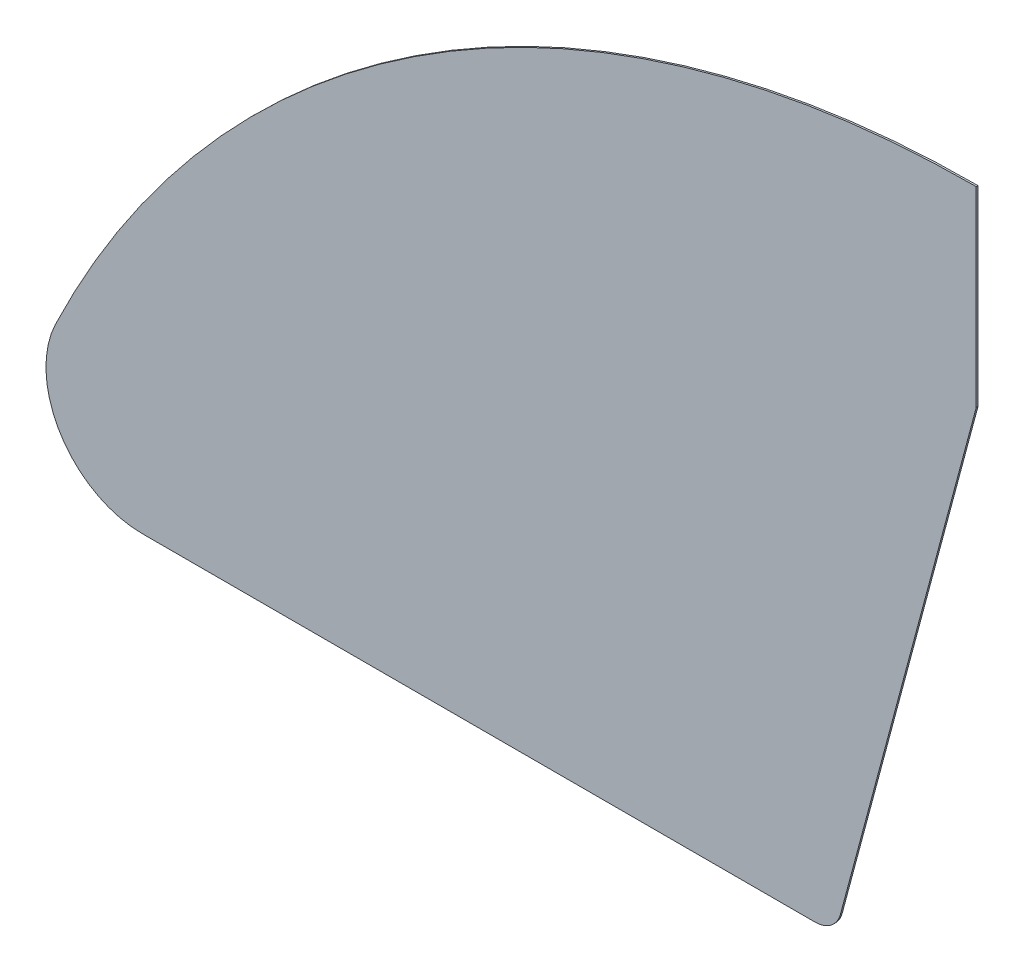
ISO-10303-21;
HEADER;
FILE_DESCRIPTION(('STEP AP214'),'2;1');
FILE_NAME('part.step','',(''),(''),'','','');
FILE_SCHEMA(('AUTOMOTIVE_DESIGN { 1 0 10303 214 1 1 1 1 }'));
ENDSEC;
DATA;
#1=APPLICATION_CONTEXT('core data for automotive mechanical design processes');
#2=APPLICATION_PROTOCOL_DEFINITION('international standard','automotive_design',2000,#1);
#3=PRODUCT_CONTEXT('',#1,'mechanical');
#4=PRODUCT('Part','Part','',(#3));
#5=PRODUCT_RELATED_PRODUCT_CATEGORY('part','',(#4));
#6=PRODUCT_DEFINITION_FORMATION('','',#4);
#7=PRODUCT_DEFINITION_CONTEXT('part definition',#1,'design');
#8=PRODUCT_DEFINITION('design','',#6,#7);
#9=PRODUCT_DEFINITION_SHAPE('','',#8);
#10=(LENGTH_UNIT() NAMED_UNIT(*) SI_UNIT(.MILLI.,.METRE.));
#11=(NAMED_UNIT(*) PLANE_ANGLE_UNIT() SI_UNIT($,.RADIAN.));
#12=(NAMED_UNIT(*) SI_UNIT($,.STERADIAN.) SOLID_ANGLE_UNIT());
#13=UNCERTAINTY_MEASURE_WITH_UNIT(LENGTH_MEASURE(1.E-05),#10,'distance_accuracy_value','');
#14=(GEOMETRIC_REPRESENTATION_CONTEXT(3) GLOBAL_UNCERTAINTY_ASSIGNED_CONTEXT((#13)) GLOBAL_UNIT_ASSIGNED_CONTEXT((#10,
#11,#12)) REPRESENTATION_CONTEXT('',''));
#15=CARTESIAN_POINT('',(0.,0.,0.));
#16=DIRECTION('',(0.,0.,1.));
#17=DIRECTION('',(1.,0.,0.));
#18=AXIS2_PLACEMENT_3D('',#15,#16,#17);
#19=CARTESIAN_POINT('',(0.955553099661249,-115.621051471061,0.2));
#20=DIRECTION('',(0.,0.,-1.));
#21=DIRECTION('',(-1.,0.,0.));
#22=AXIS2_PLACEMENT_3D('',#19,#20,#21);
#23=CYLINDRICAL_SURFACE('',#22,116.625);
#24=CARTESIAN_POINT('',(0.955553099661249,-115.621051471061,0.));
#25=DIRECTION('',(0.,0.,1.));
#26=DIRECTION('',(1.,0.,0.));
#27=AXIS2_PLACEMENT_3D('',#24,#25,#26);
#28=CIRCLE('',#27,116.625);
#29=CARTESIAN_POINT('',(1.,1.00394005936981,0.));
#30=VERTEX_POINT('',#29);
#31=CARTESIAN_POINT('',(-104.228100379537,-65.2445721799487,0.));
#32=VERTEX_POINT('',#31);
#33=EDGE_CURVE('E82',#30,#32,#28,.T.);
#34=ORIENTED_EDGE('',*,*,#33,.T.);
#35=DIRECTION('',(0.,0.,-1.));
#36=VECTOR('',#35,1.);
#37=CARTESIAN_POINT('',(-104.228100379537,-65.2445721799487,0.2));
#38=LINE('',#37,#36);
#39=CARTESIAN_POINT('',(-104.228100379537,-65.2445721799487,0.2));
#40=VERTEX_POINT('',#39);
#41=EDGE_CURVE('E11',#40,#32,#38,.T.);
#42=ORIENTED_EDGE('',*,*,#41,.F.);
#43=CARTESIAN_POINT('',(0.955553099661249,-115.621051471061,0.2));
#44=DIRECTION('',(0.,0.,1.));
#45=DIRECTION('',(1.,0.,0.));
#46=AXIS2_PLACEMENT_3D('',#43,#44,#45);
#47=CIRCLE('',#46,116.625);
#48=CARTESIAN_POINT('',(1.,1.00394005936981,0.2));
#49=VERTEX_POINT('',#48);
#50=EDGE_CURVE('E105',#49,#40,#47,.T.);
#51=ORIENTED_EDGE('',*,*,#50,.F.);
#52=DIRECTION('',(0.,0.,-1.));
#53=VECTOR('',#52,1.);
#54=CARTESIAN_POINT('',(1.,1.00394005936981,0.2));
#55=LINE('',#54,#53);
#56=EDGE_CURVE('E95',#49,#30,#55,.T.);
#57=ORIENTED_EDGE('',*,*,#56,.T.);
#58=EDGE_LOOP('',(#34,#42,#51,#57));
#59=FACE_BOUND('',#58,.T.);
#60=ADVANCED_FACE('F26',(#59),#23,.T.);
#61=CARTESIAN_POINT('',(-94.3072413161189,-69.99605147,0.2));
#62=DIRECTION('',(0.,0.,-1.));
#63=DIRECTION('',(-1.,0.,0.));
#64=AXIS2_PLACEMENT_3D('',#61,#62,#63);
#65=CYLINDRICAL_SURFACE('',#64,11.);
#66=CARTESIAN_POINT('',(-94.3072413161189,-69.99605147,0.));
#67=DIRECTION('',(0.,0.,1.));
#68=DIRECTION('',(1.,0.,0.));
#69=AXIS2_PLACEMENT_3D('',#66,#67,#68);
#70=CIRCLE('',#69,11.);
#71=CARTESIAN_POINT('',(-94.3072413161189,-80.99605147,0.));
#72=VERTEX_POINT('',#71);
#73=EDGE_CURVE('E78',#32,#72,#70,.T.);
#74=ORIENTED_EDGE('',*,*,#73,.T.);
#75=DIRECTION('',(0.,0.,-1.));
#76=VECTOR('',#75,1.);
#77=CARTESIAN_POINT('',(-94.3072413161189,-80.99605147,0.2));
#78=LINE('',#77,#76);
#79=CARTESIAN_POINT('',(-94.3072413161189,-80.99605147,0.2));
#80=VERTEX_POINT('',#79);
#81=EDGE_CURVE('E33',#80,#72,#78,.T.);
#82=ORIENTED_EDGE('',*,*,#81,.F.);
#83=CARTESIAN_POINT('',(-94.3072413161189,-69.99605147,0.2));
#84=DIRECTION('',(0.,0.,1.));
#85=DIRECTION('',(1.,0.,0.));
#86=AXIS2_PLACEMENT_3D('',#83,#84,#85);
#87=CIRCLE('',#86,11.);
#88=EDGE_CURVE('E91',#40,#80,#87,.T.);
#89=ORIENTED_EDGE('',*,*,#88,.F.);
#90=ORIENTED_EDGE('',*,*,#41,.T.);
#91=EDGE_LOOP('',(#74,#82,#89,#90));
#92=FACE_BOUND('',#91,.T.);
#93=ADVANCED_FACE('F90',(#92),#65,.T.);
#94=CARTESIAN_POINT('',(-17.4158993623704,-80.99605147,0.2));
#95=DIRECTION('',(0.,1.,0.));
#96=DIRECTION('',(0.,0.,1.));
#97=AXIS2_PLACEMENT_3D('',#94,#95,#96);
#98=PLANE('',#97);
#99=DIRECTION('',(1.,0.,0.));
#100=VECTOR('',#99,1.);
#101=CARTESIAN_POINT('',(-17.4158993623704,-80.99605147,0.));
#102=LINE('',#101,#100);
#103=CARTESIAN_POINT('',(-17.4158993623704,-80.99605147,0.));
#104=VERTEX_POINT('',#103);
#105=EDGE_CURVE('E84',#72,#104,#102,.T.);
#106=ORIENTED_EDGE('',*,*,#105,.T.);
#107=DIRECTION('',(0.,0.,-1.));
#108=VECTOR('',#107,1.);
#109=CARTESIAN_POINT('',(-17.4158993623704,-80.99605147,0.2));
#110=LINE('',#109,#108);
#111=CARTESIAN_POINT('',(-17.4158993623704,-80.99605147,0.2));
#112=VERTEX_POINT('',#111);
#113=EDGE_CURVE('E121',#112,#104,#110,.T.);
#114=ORIENTED_EDGE('',*,*,#113,.F.);
#115=DIRECTION('',(1.,0.,0.));
#116=VECTOR('',#115,1.);
#117=CARTESIAN_POINT('',(-17.4158993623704,-80.99605147,0.2));
#118=LINE('',#117,#116);
#119=EDGE_CURVE('E108',#80,#112,#118,.T.);
#120=ORIENTED_EDGE('',*,*,#119,.F.);
#121=ORIENTED_EDGE('',*,*,#81,.T.);
#122=EDGE_LOOP('',(#106,#114,#120,#121));
#123=FACE_BOUND('',#122,.T.);
#124=ADVANCED_FACE('F125',(#123),#98,.F.);
#125=CARTESIAN_POINT('',(-17.4158993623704,-77.99605147,0.2));
#126=DIRECTION('',(0.,0.,-1.));
#127=DIRECTION('',(-1.,0.,0.));
#128=AXIS2_PLACEMENT_3D('',#125,#126,#127);
#129=CYLINDRICAL_SURFACE('',#128,3.);
#130=CARTESIAN_POINT('',(-17.4158993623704,-77.99605147,0.));
#131=DIRECTION('',(0.,0.,1.));
#132=DIRECTION('',(-1.,0.,0.));
#133=AXIS2_PLACEMENT_3D('',#130,#131,#132);
#134=CIRCLE('',#133,3.);
#135=CARTESIAN_POINT('',(-14.5181218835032,-78.7725086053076,0.));
#136=VERTEX_POINT('',#135);
#137=EDGE_CURVE('E99',#104,#136,#134,.T.);
#138=ORIENTED_EDGE('',*,*,#137,.T.);
#139=DIRECTION('',(0.,0.,-1.));
#140=VECTOR('',#139,1.);
#141=CARTESIAN_POINT('',(-14.5181218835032,-78.7725086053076,0.2));
#142=LINE('',#141,#140);
#143=CARTESIAN_POINT('',(-14.5181218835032,-78.7725086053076,0.2));
#144=VERTEX_POINT('',#143);
#145=EDGE_CURVE('E118',#144,#136,#142,.T.);
#146=ORIENTED_EDGE('',*,*,#145,.F.);
#147=CARTESIAN_POINT('',(-17.4158993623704,-77.99605147,0.2));
#148=DIRECTION('',(0.,0.,1.));
#149=DIRECTION('',(-1.,0.,0.));
#150=AXIS2_PLACEMENT_3D('',#147,#148,#149);
#151=CIRCLE('',#150,3.);
#152=EDGE_CURVE('E110',#112,#144,#151,.T.);
#153=ORIENTED_EDGE('',*,*,#152,.F.);
#154=ORIENTED_EDGE('',*,*,#113,.T.);
#155=EDGE_LOOP('',(#138,#146,#153,#154));
#156=FACE_BOUND('',#155,.T.);
#157=ADVANCED_FACE('F131',(#156),#129,.T.);
#158=CARTESIAN_POINT('',(1.,-20.8580892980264,0.2));
#159=DIRECTION('',(-0.965925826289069,0.258819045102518,0.));
#160=DIRECTION('',(-0.258819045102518,-0.965925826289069,0.));
#161=AXIS2_PLACEMENT_3D('',#158,#159,#160);
#162=PLANE('',#161);
#163=DIRECTION('',(0.258819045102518,0.965925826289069,0.));
#164=VECTOR('',#163,1.);
#165=CARTESIAN_POINT('',(1.,-20.8580892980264,0.));
#166=LINE('',#165,#164);
#167=CARTESIAN_POINT('',(1.,-20.8580892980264,0.));
#168=VERTEX_POINT('',#167);
#169=EDGE_CURVE('E101',#136,#168,#166,.T.);
#170=ORIENTED_EDGE('',*,*,#169,.T.);
#171=DIRECTION('',(0.,0.,-1.));
#172=VECTOR('',#171,1.);
#173=CARTESIAN_POINT('',(1.,-20.8580892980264,0.2));
#174=LINE('',#173,#172);
#175=CARTESIAN_POINT('',(1.,-20.8580892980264,0.2));
#176=VERTEX_POINT('',#175);
#177=EDGE_CURVE('E115',#176,#168,#174,.T.);
#178=ORIENTED_EDGE('',*,*,#177,.F.);
#179=DIRECTION('',(0.258819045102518,0.965925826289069,0.));
#180=VECTOR('',#179,1.);
#181=CARTESIAN_POINT('',(1.,-20.8580892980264,0.2));
#182=LINE('',#181,#180);
#183=EDGE_CURVE('E45',#144,#176,#182,.T.);
#184=ORIENTED_EDGE('',*,*,#183,.F.);
#185=ORIENTED_EDGE('',*,*,#145,.T.);
#186=EDGE_LOOP('',(#170,#178,#184,#185));
#187=FACE_BOUND('',#186,.T.);
#188=ADVANCED_FACE('F134',(#187),#162,.F.);
#189=CARTESIAN_POINT('',(1.,1.00394005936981,0.2));
#190=DIRECTION('',(-1.,0.,0.));
#191=DIRECTION('',(0.,0.,1.));
#192=AXIS2_PLACEMENT_3D('',#189,#190,#191);
#193=PLANE('',#192);
#194=DIRECTION('',(0.,1.,0.));
#195=VECTOR('',#194,1.);
#196=CARTESIAN_POINT('',(1.,1.00394005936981,0.));
#197=LINE('',#196,#195);
#198=EDGE_CURVE('E103',#168,#30,#197,.T.);
#199=ORIENTED_EDGE('',*,*,#198,.T.);
#200=ORIENTED_EDGE('',*,*,#56,.F.);
#201=DIRECTION('',(0.,1.,0.));
#202=VECTOR('',#201,1.);
#203=CARTESIAN_POINT('',(1.,1.00394005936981,0.2));
#204=LINE('',#203,#202);
#205=EDGE_CURVE('E40',#176,#49,#204,.T.);
#206=ORIENTED_EDGE('',*,*,#205,.F.);
#207=ORIENTED_EDGE('',*,*,#177,.T.);
#208=EDGE_LOOP('',(#199,#200,#206,#207));
#209=FACE_BOUND('',#208,.T.);
#210=ADVANCED_FACE('F136',(#209),#193,.F.);
#211=CARTESIAN_POINT('',(0.955553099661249,-115.621051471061,0.2));
#212=DIRECTION('',(0.,0.,1.));
#213=DIRECTION('',(1.,0.,0.));
#214=AXIS2_PLACEMENT_3D('',#211,#212,#213);
#215=PLANE('',#214);
#216=ORIENTED_EDGE('',*,*,#50,.T.);
#217=ORIENTED_EDGE('',*,*,#88,.T.);
#218=ORIENTED_EDGE('',*,*,#119,.T.);
#219=ORIENTED_EDGE('',*,*,#152,.T.);
#220=ORIENTED_EDGE('',*,*,#183,.T.);
#221=ORIENTED_EDGE('',*,*,#205,.T.);
#222=EDGE_LOOP('',(#216,#217,#218,#219,#220,#221));
#223=FACE_BOUND('',#222,.T.);
#224=ADVANCED_FACE('F128',(#223),#215,.T.);
#225=CARTESIAN_POINT('',(0.955553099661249,-115.621051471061,0.));
#226=DIRECTION('',(0.,0.,1.));
#227=DIRECTION('',(1.,0.,0.));
#228=AXIS2_PLACEMENT_3D('',#225,#226,#227);
#229=PLANE('',#228);
#230=ORIENTED_EDGE('',*,*,#33,.F.);
#231=ORIENTED_EDGE('',*,*,#198,.F.);
#232=ORIENTED_EDGE('',*,*,#169,.F.);
#233=ORIENTED_EDGE('',*,*,#137,.F.);
#234=ORIENTED_EDGE('',*,*,#105,.F.);
#235=ORIENTED_EDGE('',*,*,#73,.F.);
#236=EDGE_LOOP('',(#230,#231,#232,#233,#234,#235));
#237=FACE_BOUND('',#236,.T.);
#238=ADVANCED_FACE('F79',(#237),#229,.F.);
#239=CLOSED_SHELL('',(#60,#93,#124,#157,#188,#210,#224,#238));
#240=MANIFOLD_SOLID_BREP('B2',#239);
#241=ADVANCED_BREP_SHAPE_REPRESENTATION('',(#18,#240),#14);
#242=SHAPE_DEFINITION_REPRESENTATION(#9,#241);
ENDSEC;
END-ISO-10303-21;
